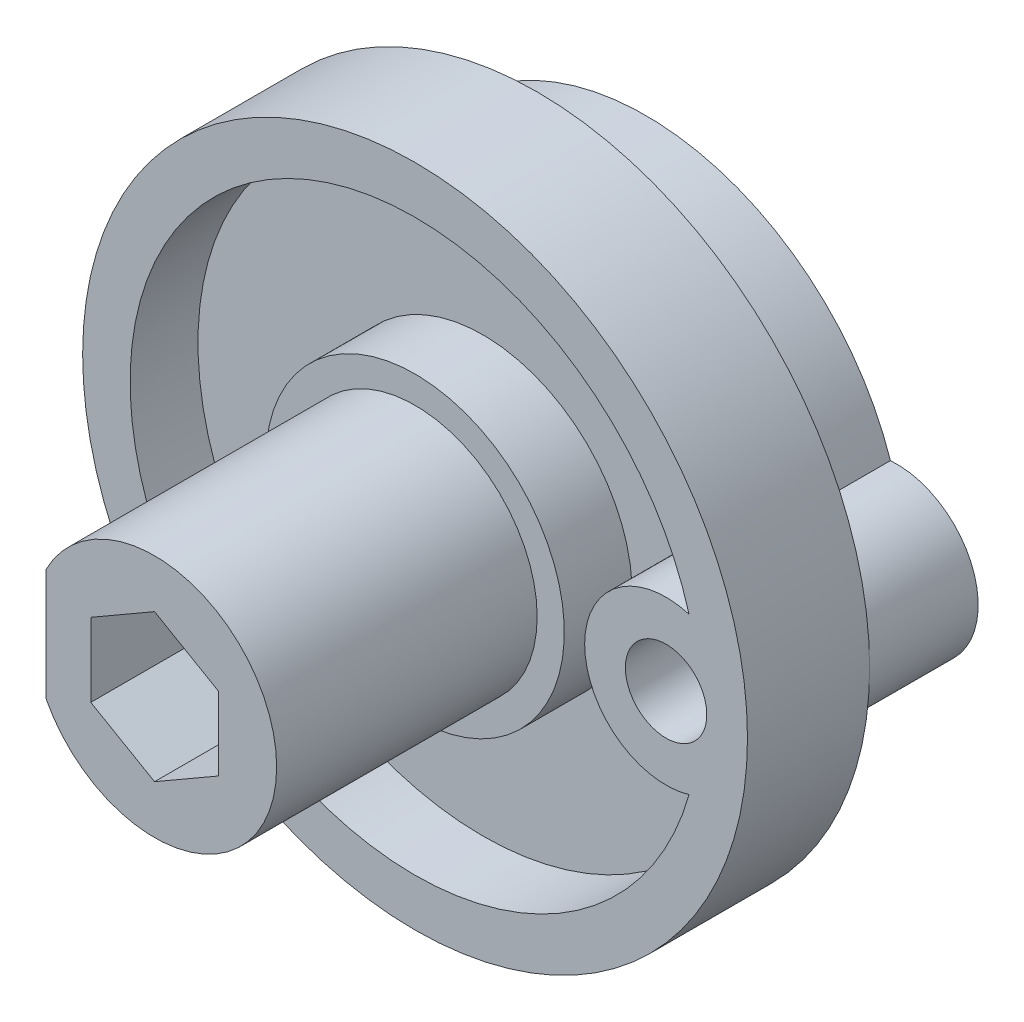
ISO-10303-21;
HEADER;
FILE_DESCRIPTION(('STEP AP214'),'2;1');
FILE_NAME('part.step','',(''),(''),'','','');
FILE_SCHEMA(('AUTOMOTIVE_DESIGN { 1 0 10303 214 1 1 1 1 }'));
ENDSEC;
DATA;
#1=APPLICATION_CONTEXT('core data for automotive mechanical design processes');
#2=APPLICATION_PROTOCOL_DEFINITION('international standard','automotive_design',2000,#1);
#3=PRODUCT_CONTEXT('',#1,'mechanical');
#4=PRODUCT('Part','Part','',(#3));
#5=PRODUCT_RELATED_PRODUCT_CATEGORY('part','',(#4));
#6=PRODUCT_DEFINITION_FORMATION('','',#4);
#7=PRODUCT_DEFINITION_CONTEXT('part definition',#1,'design');
#8=PRODUCT_DEFINITION('design','',#6,#7);
#9=PRODUCT_DEFINITION_SHAPE('','',#8);
#10=(LENGTH_UNIT() NAMED_UNIT(*) SI_UNIT(.MILLI.,.METRE.));
#11=(NAMED_UNIT(*) PLANE_ANGLE_UNIT() SI_UNIT($,.RADIAN.));
#12=(NAMED_UNIT(*) SI_UNIT($,.STERADIAN.) SOLID_ANGLE_UNIT());
#13=UNCERTAINTY_MEASURE_WITH_UNIT(LENGTH_MEASURE(1.E-05),#10,'distance_accuracy_value','');
#14=(GEOMETRIC_REPRESENTATION_CONTEXT(3) GLOBAL_UNCERTAINTY_ASSIGNED_CONTEXT((#13)) GLOBAL_UNIT_ASSIGNED_CONTEXT((#10,
#11,#12)) REPRESENTATION_CONTEXT('',''));
#15=CARTESIAN_POINT('',(0.,0.,0.));
#16=DIRECTION('',(0.,0.,1.));
#17=DIRECTION('',(1.,0.,0.));
#18=AXIS2_PLACEMENT_3D('',#15,#16,#17);
#19=CARTESIAN_POINT('',(-4.,-2.06155281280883,14.1));
#20=DIRECTION('',(1.,0.,0.));
#21=DIRECTION('',(0.,0.,-1.));
#22=AXIS2_PLACEMENT_3D('',#19,#20,#21);
#23=PLANE('',#22);
#24=DIRECTION('',(0.,0.,1.));
#25=VECTOR('',#24,1.);
#26=CARTESIAN_POINT('',(-4.,-2.06155281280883,4.5));
#27=LINE('',#26,#25);
#28=CARTESIAN_POINT('',(-4.,-2.06155281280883,14.1));
#29=VERTEX_POINT('',#28);
#30=CARTESIAN_POINT('',(-4.,-2.06155281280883,4.5));
#31=VERTEX_POINT('',#30);
#32=EDGE_CURVE('E184',#29,#31,#27,.F.);
#33=ORIENTED_EDGE('',*,*,#32,.F.);
#34=DIRECTION('',(0.,1.,0.));
#35=VECTOR('',#34,1.);
#36=CARTESIAN_POINT('',(-4.,0.,14.1));
#37=LINE('',#36,#35);
#38=CARTESIAN_POINT('',(-4.,2.06155281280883,14.1));
#39=VERTEX_POINT('',#38);
#40=EDGE_CURVE('E186',#29,#39,#37,.T.);
#41=ORIENTED_EDGE('',*,*,#40,.T.);
#42=DIRECTION('',(0.,0.,1.));
#43=VECTOR('',#42,1.);
#44=CARTESIAN_POINT('',(-4.,2.06155281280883,4.5));
#45=LINE('',#44,#43);
#46=CARTESIAN_POINT('',(-4.,2.06155281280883,4.5));
#47=VERTEX_POINT('',#46);
#48=EDGE_CURVE('E179',#47,#39,#45,.T.);
#49=ORIENTED_EDGE('',*,*,#48,.F.);
#50=DIRECTION('',(0.,1.,0.));
#51=VECTOR('',#50,1.);
#52=CARTESIAN_POINT('',(-4.,0.,4.5));
#53=LINE('',#52,#51);
#54=EDGE_CURVE('E189',#47,#31,#53,.F.);
#55=ORIENTED_EDGE('',*,*,#54,.T.);
#56=EDGE_LOOP('',(#33,#41,#49,#55));
#57=FACE_BOUND('',#56,.T.);
#58=ADVANCED_FACE('F16',(#57),#23,.F.);
#59=CARTESIAN_POINT('',(0.,0.,4.5));
#60=DIRECTION('',(0.,0.,1.));
#61=DIRECTION('',(1.,0.,0.));
#62=AXIS2_PLACEMENT_3D('',#59,#60,#61);
#63=CYLINDRICAL_SURFACE('',#62,4.5);
#64=ORIENTED_EDGE('',*,*,#32,.T.);
#65=CARTESIAN_POINT('',(0.,0.,4.5));
#66=DIRECTION('',(0.,0.,1.));
#67=DIRECTION('',(1.,0.,0.));
#68=AXIS2_PLACEMENT_3D('',#65,#66,#67);
#69=CIRCLE('',#68,4.5);
#70=EDGE_CURVE('E196',#31,#47,#69,.T.);
#71=ORIENTED_EDGE('',*,*,#70,.T.);
#72=ORIENTED_EDGE('',*,*,#48,.T.);
#73=CARTESIAN_POINT('',(0.,0.,14.1));
#74=DIRECTION('',(0.,0.,1.));
#75=DIRECTION('',(1.,0.,0.));
#76=AXIS2_PLACEMENT_3D('',#73,#74,#75);
#77=CIRCLE('',#76,4.5);
#78=EDGE_CURVE('E20',#39,#29,#77,.F.);
#79=ORIENTED_EDGE('',*,*,#78,.T.);
#80=EDGE_LOOP('',(#64,#71,#72,#79));
#81=FACE_BOUND('',#80,.T.);
#82=ADVANCED_FACE('F192',(#81),#63,.T.);
#83=CARTESIAN_POINT('',(0.,0.,0.));
#84=DIRECTION('',(0.,0.,-1.));
#85=DIRECTION('',(-1.,0.,0.));
#86=AXIS2_PLACEMENT_3D('',#83,#84,#85);
#87=PLANE('',#86);
#88=CARTESIAN_POINT('',(0.,0.,0.));
#89=DIRECTION('',(0.,0.,1.));
#90=DIRECTION('',(1.,0.,0.));
#91=AXIS2_PLACEMENT_3D('',#88,#89,#90);
#92=CIRCLE('',#91,4.);
#93=CARTESIAN_POINT('',(3.92905841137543,-0.750000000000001,0.));
#94=VERTEX_POINT('',#93);
#95=CARTESIAN_POINT('',(0.749999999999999,-3.92905841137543,0.));
#96=VERTEX_POINT('',#95);
#97=EDGE_CURVE('E357',#94,#96,#92,.F.);
#98=ORIENTED_EDGE('',*,*,#97,.F.);
#99=DIRECTION('',(1.,0.,0.));
#100=VECTOR('',#99,1.);
#101=CARTESIAN_POINT('',(3.92905841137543,-0.750000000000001,0.));
#102=LINE('',#101,#100);
#103=CARTESIAN_POINT('',(6.34526249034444,-0.750000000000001,0.));
#104=VERTEX_POINT('',#103);
#105=EDGE_CURVE('E350',#104,#94,#102,.F.);
#106=ORIENTED_EDGE('',*,*,#105,.F.);
#107=CARTESIAN_POINT('',(9.25,0.,0.));
#108=DIRECTION('',(0.,0.,-1.));
#109=DIRECTION('',(-1.,0.,0.));
#110=AXIS2_PLACEMENT_3D('',#107,#108,#109);
#111=CIRCLE('',#110,3.);
#112=CARTESIAN_POINT('',(7.59797297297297,-2.50415788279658,0.));
#113=VERTEX_POINT('',#112);
#114=EDGE_CURVE('E440',#113,#104,#111,.T.);
#115=ORIENTED_EDGE('',*,*,#114,.F.);
#116=CARTESIAN_POINT('',(0.,0.,0.));
#117=DIRECTION('',(0.,0.,1.));
#118=DIRECTION('',(1.,0.,0.));
#119=AXIS2_PLACEMENT_3D('',#116,#117,#118);
#120=CIRCLE('',#119,8.);
#121=CARTESIAN_POINT('',(0.749999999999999,-7.964766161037,0.));
#122=VERTEX_POINT('',#121);
#123=EDGE_CURVE('E365',#113,#122,#120,.F.);
#124=ORIENTED_EDGE('',*,*,#123,.T.);
#125=DIRECTION('',(0.,1.,0.));
#126=VECTOR('',#125,1.);
#127=CARTESIAN_POINT('',(0.749999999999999,-7.964766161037,0.));
#128=LINE('',#127,#126);
#129=EDGE_CURVE('E361',#96,#122,#128,.F.);
#130=ORIENTED_EDGE('',*,*,#129,.F.);
#131=EDGE_LOOP('',(#98,#106,#115,#124,#130));
#132=FACE_BOUND('',#131,.T.);
#133=ADVANCED_FACE('F670',(#132),#87,.T.);
#134=CARTESIAN_POINT('',(0.,0.,0.));
#135=DIRECTION('',(0.,0.,-1.));
#136=DIRECTION('',(-1.,0.,0.));
#137=AXIS2_PLACEMENT_3D('',#134,#135,#136);
#138=PLANE('',#137);
#139=DIRECTION('',(0.,1.,0.));
#140=VECTOR('',#139,1.);
#141=CARTESIAN_POINT('',(0.750000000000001,3.92905841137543,0.));
#142=LINE('',#141,#140);
#143=CARTESIAN_POINT('',(0.750000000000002,7.96476616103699,0.));
#144=VERTEX_POINT('',#143);
#145=CARTESIAN_POINT('',(0.750000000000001,3.92905841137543,0.));
#146=VERTEX_POINT('',#145);
#147=EDGE_CURVE('E341',#144,#146,#142,.F.);
#148=ORIENTED_EDGE('',*,*,#147,.F.);
#149=CARTESIAN_POINT('',(0.,0.,0.));
#150=DIRECTION('',(0.,0.,1.));
#151=DIRECTION('',(1.,0.,0.));
#152=AXIS2_PLACEMENT_3D('',#149,#150,#151);
#153=CIRCLE('',#152,8.);
#154=CARTESIAN_POINT('',(7.59797297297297,2.50415788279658,0.));
#155=VERTEX_POINT('',#154);
#156=EDGE_CURVE('E334',#144,#155,#153,.F.);
#157=ORIENTED_EDGE('',*,*,#156,.T.);
#158=CARTESIAN_POINT('',(9.25,0.,0.));
#159=DIRECTION('',(0.,0.,-1.));
#160=DIRECTION('',(-1.,0.,0.));
#161=AXIS2_PLACEMENT_3D('',#158,#159,#160);
#162=CIRCLE('',#161,3.);
#163=CARTESIAN_POINT('',(6.34526249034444,0.75,0.));
#164=VERTEX_POINT('',#163);
#165=EDGE_CURVE('E330',#164,#155,#162,.T.);
#166=ORIENTED_EDGE('',*,*,#165,.F.);
#167=DIRECTION('',(1.,0.,0.));
#168=VECTOR('',#167,1.);
#169=CARTESIAN_POINT('',(7.964766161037,0.75,0.));
#170=LINE('',#169,#168);
#171=CARTESIAN_POINT('',(3.92905841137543,0.75,0.));
#172=VERTEX_POINT('',#171);
#173=EDGE_CURVE('E349',#172,#164,#170,.T.);
#174=ORIENTED_EDGE('',*,*,#173,.F.);
#175=CARTESIAN_POINT('',(0.,0.,0.));
#176=DIRECTION('',(0.,0.,1.));
#177=DIRECTION('',(1.,0.,0.));
#178=AXIS2_PLACEMENT_3D('',#175,#176,#177);
#179=CIRCLE('',#178,4.);
#180=EDGE_CURVE('E345',#146,#172,#179,.F.);
#181=ORIENTED_EDGE('',*,*,#180,.F.);
#182=EDGE_LOOP('',(#148,#157,#166,#174,#181));
#183=FACE_BOUND('',#182,.T.);
#184=ADVANCED_FACE('F667',(#183),#138,.T.);
#185=CARTESIAN_POINT('',(0.,0.,14.1));
#186=DIRECTION('',(0.,0.,-1.));
#187=DIRECTION('',(-1.,0.,0.));
#188=AXIS2_PLACEMENT_3D('',#185,#186,#187);
#189=PLANE('',#188);
#190=DIRECTION('',(0.,1.,0.));
#191=VECTOR('',#190,1.);
#192=CARTESIAN_POINT('',(2.35,-1.35677313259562,14.1));
#193=LINE('',#192,#191);
#194=CARTESIAN_POINT('',(2.35,1.35677313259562,14.1));
#195=VERTEX_POINT('',#194);
#196=CARTESIAN_POINT('',(2.35,-1.35677313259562,14.1));
#197=VERTEX_POINT('',#196);
#198=EDGE_CURVE('E199',#195,#197,#193,.F.);
#199=ORIENTED_EDGE('',*,*,#198,.T.);
#200=DIRECTION('',(0.866025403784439,0.5,0.));
#201=VECTOR('',#200,1.);
#202=CARTESIAN_POINT('',(0.,-2.71354626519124,14.1));
#203=LINE('',#202,#201);
#204=CARTESIAN_POINT('',(0.,-2.71354626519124,14.1));
#205=VERTEX_POINT('',#204);
#206=EDGE_CURVE('E204',#197,#205,#203,.F.);
#207=ORIENTED_EDGE('',*,*,#206,.T.);
#208=DIRECTION('',(0.866025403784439,-0.5,0.));
#209=VECTOR('',#208,1.);
#210=CARTESIAN_POINT('',(-2.35,-1.35677313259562,14.1));
#211=LINE('',#210,#209);
#212=CARTESIAN_POINT('',(-2.35,-1.35677313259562,14.1));
#213=VERTEX_POINT('',#212);
#214=EDGE_CURVE('E210',#205,#213,#211,.F.);
#215=ORIENTED_EDGE('',*,*,#214,.T.);
#216=DIRECTION('',(0.,1.,0.));
#217=VECTOR('',#216,1.);
#218=CARTESIAN_POINT('',(-2.35,1.35677313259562,14.1));
#219=LINE('',#218,#217);
#220=CARTESIAN_POINT('',(-2.35,1.35677313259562,14.1));
#221=VERTEX_POINT('',#220);
#222=EDGE_CURVE('E216',#213,#221,#219,.T.);
#223=ORIENTED_EDGE('',*,*,#222,.T.);
#224=DIRECTION('',(-0.866025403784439,-0.5,0.));
#225=VECTOR('',#224,1.);
#226=CARTESIAN_POINT('',(0.,2.71354626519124,14.1));
#227=LINE('',#226,#225);
#228=CARTESIAN_POINT('',(0.,2.71354626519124,14.1));
#229=VERTEX_POINT('',#228);
#230=EDGE_CURVE('E222',#221,#229,#227,.F.);
#231=ORIENTED_EDGE('',*,*,#230,.T.);
#232=DIRECTION('',(-0.866025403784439,0.5,0.));
#233=VECTOR('',#232,1.);
#234=CARTESIAN_POINT('',(2.35,1.35677313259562,14.1));
#235=LINE('',#234,#233);
#236=EDGE_CURVE('E232',#229,#195,#235,.F.);
#237=ORIENTED_EDGE('',*,*,#236,.T.);
#238=EDGE_LOOP('',(#199,#207,#215,#223,#231,#237));
#239=FACE_BOUND('',#238,.T.);
#240=ORIENTED_EDGE('',*,*,#78,.F.);
#241=ORIENTED_EDGE('',*,*,#40,.F.);
#242=EDGE_LOOP('',(#240,#241));
#243=FACE_BOUND('',#242,.T.);
#244=ADVANCED_FACE('F194',(#239,#243),#189,.F.);
#245=CARTESIAN_POINT('',(0.,0.,0.));
#246=DIRECTION('',(0.,0.,-1.));
#247=DIRECTION('',(-1.,0.,0.));
#248=AXIS2_PLACEMENT_3D('',#245,#246,#247);
#249=PLANE('',#248);
#250=DIRECTION('',(1.,0.,0.));
#251=VECTOR('',#250,1.);
#252=CARTESIAN_POINT('',(-7.964766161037,-0.749999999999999,0.));
#253=LINE('',#252,#251);
#254=CARTESIAN_POINT('',(-3.92905841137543,-0.749999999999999,0.));
#255=VERTEX_POINT('',#254);
#256=CARTESIAN_POINT('',(-7.964766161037,-0.749999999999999,0.));
#257=VERTEX_POINT('',#256);
#258=EDGE_CURVE('E327',#255,#257,#253,.F.);
#259=ORIENTED_EDGE('',*,*,#258,.F.);
#260=CARTESIAN_POINT('',(0.,0.,0.));
#261=DIRECTION('',(0.,0.,1.));
#262=DIRECTION('',(1.,0.,0.));
#263=AXIS2_PLACEMENT_3D('',#260,#261,#262);
#264=CIRCLE('',#263,4.);
#265=CARTESIAN_POINT('',(-0.75,-3.92905841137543,0.));
#266=VERTEX_POINT('',#265);
#267=EDGE_CURVE('E323',#266,#255,#264,.F.);
#268=ORIENTED_EDGE('',*,*,#267,.F.);
#269=DIRECTION('',(0.,1.,0.));
#270=VECTOR('',#269,1.);
#271=CARTESIAN_POINT('',(-0.75,-3.92905841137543,0.));
#272=LINE('',#271,#270);
#273=CARTESIAN_POINT('',(-0.75,-7.964766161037,0.));
#274=VERTEX_POINT('',#273);
#275=EDGE_CURVE('E316',#274,#266,#272,.T.);
#276=ORIENTED_EDGE('',*,*,#275,.F.);
#277=CARTESIAN_POINT('',(0.,0.,0.));
#278=DIRECTION('',(0.,0.,1.));
#279=DIRECTION('',(1.,0.,0.));
#280=AXIS2_PLACEMENT_3D('',#277,#278,#279);
#281=CIRCLE('',#280,8.);
#282=EDGE_CURVE('E231',#274,#257,#281,.F.);
#283=ORIENTED_EDGE('',*,*,#282,.T.);
#284=EDGE_LOOP('',(#259,#268,#276,#283));
#285=FACE_BOUND('',#284,.T.);
#286=ADVANCED_FACE('F660',(#285),#249,.T.);
#287=CARTESIAN_POINT('',(0.,0.,0.));
#288=DIRECTION('',(0.,0.,-1.));
#289=DIRECTION('',(-1.,0.,0.));
#290=AXIS2_PLACEMENT_3D('',#287,#288,#289);
#291=PLANE('',#290);
#292=DIRECTION('',(1.,0.,0.));
#293=VECTOR('',#292,1.);
#294=CARTESIAN_POINT('',(-3.92905841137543,0.75,0.));
#295=LINE('',#294,#293);
#296=CARTESIAN_POINT('',(-7.964766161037,0.75,0.));
#297=VERTEX_POINT('',#296);
#298=CARTESIAN_POINT('',(-3.92905841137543,0.75,0.));
#299=VERTEX_POINT('',#298);
#300=EDGE_CURVE('E307',#297,#299,#295,.T.);
#301=ORIENTED_EDGE('',*,*,#300,.F.);
#302=CARTESIAN_POINT('',(0.,0.,0.));
#303=DIRECTION('',(0.,0.,1.));
#304=DIRECTION('',(1.,0.,0.));
#305=AXIS2_PLACEMENT_3D('',#302,#303,#304);
#306=CIRCLE('',#305,8.);
#307=CARTESIAN_POINT('',(-0.75,7.964766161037,0.));
#308=VERTEX_POINT('',#307);
#309=EDGE_CURVE('E300',#297,#308,#306,.F.);
#310=ORIENTED_EDGE('',*,*,#309,.T.);
#311=DIRECTION('',(0.,1.,0.));
#312=VECTOR('',#311,1.);
#313=CARTESIAN_POINT('',(-0.75,7.964766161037,0.));
#314=LINE('',#313,#312);
#315=CARTESIAN_POINT('',(-0.75,3.92905841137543,0.));
#316=VERTEX_POINT('',#315);
#317=EDGE_CURVE('E312',#316,#308,#314,.T.);
#318=ORIENTED_EDGE('',*,*,#317,.F.);
#319=CARTESIAN_POINT('',(0.,0.,0.));
#320=DIRECTION('',(0.,0.,1.));
#321=DIRECTION('',(1.,0.,0.));
#322=AXIS2_PLACEMENT_3D('',#319,#320,#321);
#323=CIRCLE('',#322,4.);
#324=EDGE_CURVE('E311',#299,#316,#323,.F.);
#325=ORIENTED_EDGE('',*,*,#324,.F.);
#326=EDGE_LOOP('',(#301,#310,#318,#325));
#327=FACE_BOUND('',#326,.T.);
#328=ADVANCED_FACE('F446',(#327),#291,.T.);
#329=CARTESIAN_POINT('',(0.,0.,4.5));
#330=DIRECTION('',(0.,0.,-1.));
#331=DIRECTION('',(-1.,0.,0.));
#332=AXIS2_PLACEMENT_3D('',#329,#330,#331);
#333=PLANE('',#332);
#334=ORIENTED_EDGE('',*,*,#54,.F.);
#335=ORIENTED_EDGE('',*,*,#70,.F.);
#336=EDGE_LOOP('',(#334,#335));
#337=FACE_BOUND('',#336,.T.);
#338=CARTESIAN_POINT('',(0.,0.,4.5));
#339=DIRECTION('',(0.,0.,-1.));
#340=DIRECTION('',(-1.,0.,0.));
#341=AXIS2_PLACEMENT_3D('',#338,#339,#340);
#342=CIRCLE('',#341,5.5);
#343=CARTESIAN_POINT('',(-5.5,0.,4.5));
#344=VERTEX_POINT('',#343);
#345=EDGE_CURVE('E299',#344,#344,#342,.T.);
#346=ORIENTED_EDGE('',*,*,#345,.F.);
#347=EDGE_LOOP('',(#346));
#348=FACE_BOUND('',#347,.T.);
#349=ADVANCED_FACE('F442',(#337,#348),#333,.F.);
#350=CARTESIAN_POINT('',(9.25,0.,4.5));
#351=DIRECTION('',(0.,0.,-1.));
#352=DIRECTION('',(-1.,0.,0.));
#353=AXIS2_PLACEMENT_3D('',#350,#351,#352);
#354=CYLINDRICAL_SURFACE('',#353,3.);
#355=DIRECTION('',(0.,0.,1.));
#356=VECTOR('',#355,1.);
#357=CARTESIAN_POINT('',(7.59797297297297,-2.50415788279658,-4.));
#358=LINE('',#357,#356);
#359=CARTESIAN_POINT('',(7.59797297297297,-2.50415788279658,-4.));
#360=VERTEX_POINT('',#359);
#361=EDGE_CURVE('E362',#360,#113,#358,.T.);
#362=ORIENTED_EDGE('',*,*,#361,.T.);
#363=ORIENTED_EDGE('',*,*,#114,.T.);
#364=DIRECTION('',(0.,0.,-1.));
#365=VECTOR('',#364,1.);
#366=CARTESIAN_POINT('',(6.34526249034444,-0.750000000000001,0.));
#367=LINE('',#366,#365);
#368=CARTESIAN_POINT('',(6.34526249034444,-0.750000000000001,-4.));
#369=VERTEX_POINT('',#368);
#370=EDGE_CURVE('E351',#369,#104,#367,.F.);
#371=ORIENTED_EDGE('',*,*,#370,.F.);
#372=CARTESIAN_POINT('',(9.25,0.,-4.));
#373=DIRECTION('',(0.,0.,-1.));
#374=DIRECTION('',(-1.,0.,0.));
#375=AXIS2_PLACEMENT_3D('',#372,#373,#374);
#376=CIRCLE('',#375,3.);
#377=EDGE_CURVE('E422',#369,#360,#376,.F.);
#378=ORIENTED_EDGE('',*,*,#377,.T.);
#379=EDGE_LOOP('',(#362,#363,#371,#378));
#380=FACE_BOUND('',#379,.T.);
#381=ADVANCED_FACE('F445',(#380),#354,.T.);
#382=CARTESIAN_POINT('',(0.,0.,-4.));
#383=DIRECTION('',(0.,0.,1.));
#384=DIRECTION('',(1.,0.,0.));
#385=AXIS2_PLACEMENT_3D('',#382,#383,#384);
#386=CYLINDRICAL_SURFACE('',#385,8.);
#387=CARTESIAN_POINT('',(0.,0.,-4.));
#388=DIRECTION('',(0.,0.,1.));
#389=DIRECTION('',(1.,0.,0.));
#390=AXIS2_PLACEMENT_3D('',#387,#388,#389);
#391=CIRCLE('',#390,8.);
#392=CARTESIAN_POINT('',(0.749999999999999,-7.964766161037,-4.));
#393=VERTEX_POINT('',#392);
#394=EDGE_CURVE('E281',#360,#393,#391,.F.);
#395=ORIENTED_EDGE('',*,*,#394,.T.);
#396=DIRECTION('',(0.,0.,-1.));
#397=VECTOR('',#396,1.);
#398=CARTESIAN_POINT('',(0.749999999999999,-7.964766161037,0.));
#399=LINE('',#398,#397);
#400=EDGE_CURVE('E358',#122,#393,#399,.T.);
#401=ORIENTED_EDGE('',*,*,#400,.F.);
#402=ORIENTED_EDGE('',*,*,#123,.F.);
#403=ORIENTED_EDGE('',*,*,#361,.F.);
#404=EDGE_LOOP('',(#395,#401,#402,#403));
#405=FACE_BOUND('',#404,.T.);
#406=ADVANCED_FACE('F650',(#405),#386,.F.);
#407=CARTESIAN_POINT('',(0.749999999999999,-7.964766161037,0.));
#408=DIRECTION('',(1.,0.,0.));
#409=DIRECTION('',(0.,0.,-1.));
#410=AXIS2_PLACEMENT_3D('',#407,#408,#409);
#411=PLANE('',#410);
#412=ORIENTED_EDGE('',*,*,#129,.T.);
#413=ORIENTED_EDGE('',*,*,#400,.T.);
#414=DIRECTION('',(0.,1.,0.));
#415=VECTOR('',#414,1.);
#416=CARTESIAN_POINT('',(0.749999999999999,0.,-4.));
#417=LINE('',#416,#415);
#418=CARTESIAN_POINT('',(0.749999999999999,-3.92905841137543,-4.));
#419=VERTEX_POINT('',#418);
#420=EDGE_CURVE('E279',#393,#419,#417,.T.);
#421=ORIENTED_EDGE('',*,*,#420,.T.);
#422=DIRECTION('',(0.,0.,1.));
#423=VECTOR('',#422,1.);
#424=CARTESIAN_POINT('',(0.75,-3.92905841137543,-4.));
#425=LINE('',#424,#423);
#426=EDGE_CURVE('E354',#96,#419,#425,.F.);
#427=ORIENTED_EDGE('',*,*,#426,.F.);
#428=EDGE_LOOP('',(#412,#413,#421,#427));
#429=FACE_BOUND('',#428,.T.);
#430=ADVANCED_FACE('F646',(#429),#411,.T.);
#431=CARTESIAN_POINT('',(0.,0.,-4.));
#432=DIRECTION('',(0.,0.,1.));
#433=DIRECTION('',(1.,0.,0.));
#434=AXIS2_PLACEMENT_3D('',#431,#432,#433);
#435=CYLINDRICAL_SURFACE('',#434,4.);
#436=ORIENTED_EDGE('',*,*,#426,.T.);
#437=CARTESIAN_POINT('',(0.,0.,-4.));
#438=DIRECTION('',(0.,0.,1.));
#439=DIRECTION('',(1.,0.,0.));
#440=AXIS2_PLACEMENT_3D('',#437,#438,#439);
#441=CIRCLE('',#440,4.);
#442=CARTESIAN_POINT('',(3.92905841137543,-0.750000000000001,-4.));
#443=VERTEX_POINT('',#442);
#444=EDGE_CURVE('E278',#419,#443,#441,.T.);
#445=ORIENTED_EDGE('',*,*,#444,.T.);
#446=DIRECTION('',(0.,0.,-1.));
#447=VECTOR('',#446,1.);
#448=CARTESIAN_POINT('',(3.92905841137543,-0.750000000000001,0.));
#449=LINE('',#448,#447);
#450=EDGE_CURVE('E346',#94,#443,#449,.T.);
#451=ORIENTED_EDGE('',*,*,#450,.F.);
#452=ORIENTED_EDGE('',*,*,#97,.T.);
#453=EDGE_LOOP('',(#436,#445,#451,#452));
#454=FACE_BOUND('',#453,.T.);
#455=ADVANCED_FACE('F642',(#454),#435,.T.);
#456=CARTESIAN_POINT('',(3.92905841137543,-0.750000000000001,0.));
#457=DIRECTION('',(0.,-1.,0.));
#458=DIRECTION('',(0.,0.,-1.));
#459=AXIS2_PLACEMENT_3D('',#456,#457,#458);
#460=PLANE('',#459);
#461=ORIENTED_EDGE('',*,*,#450,.T.);
#462=DIRECTION('',(1.,0.,0.));
#463=VECTOR('',#462,1.);
#464=CARTESIAN_POINT('',(0.,-0.750000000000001,-4.));
#465=LINE('',#464,#463);
#466=EDGE_CURVE('E275',#443,#369,#465,.T.);
#467=ORIENTED_EDGE('',*,*,#466,.T.);
#468=ORIENTED_EDGE('',*,*,#370,.T.);
#469=ORIENTED_EDGE('',*,*,#105,.T.);
#470=EDGE_LOOP('',(#461,#467,#468,#469));
#471=FACE_BOUND('',#470,.T.);
#472=ADVANCED_FACE('F638',(#471),#460,.T.);
#473=CARTESIAN_POINT('',(7.964766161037,0.75,0.));
#474=DIRECTION('',(0.,1.,0.));
#475=DIRECTION('',(0.,0.,1.));
#476=AXIS2_PLACEMENT_3D('',#473,#474,#475);
#477=PLANE('',#476);
#478=DIRECTION('',(0.,0.,1.));
#479=VECTOR('',#478,1.);
#480=CARTESIAN_POINT('',(3.92905841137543,0.75,-4.));
#481=LINE('',#480,#479);
#482=CARTESIAN_POINT('',(3.92905841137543,0.75,-4.));
#483=VERTEX_POINT('',#482);
#484=EDGE_CURVE('E342',#172,#483,#481,.F.);
#485=ORIENTED_EDGE('',*,*,#484,.F.);
#486=ORIENTED_EDGE('',*,*,#173,.T.);
#487=DIRECTION('',(0.,0.,-1.));
#488=VECTOR('',#487,1.);
#489=CARTESIAN_POINT('',(6.34526249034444,0.750000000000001,4.5));
#490=LINE('',#489,#488);
#491=CARTESIAN_POINT('',(6.34526249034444,0.75,-4.));
#492=VERTEX_POINT('',#491);
#493=EDGE_CURVE('E331',#492,#164,#490,.F.);
#494=ORIENTED_EDGE('',*,*,#493,.F.);
#495=DIRECTION('',(1.,0.,0.));
#496=VECTOR('',#495,1.);
#497=CARTESIAN_POINT('',(0.,0.75,-4.));
#498=LINE('',#497,#496);
#499=EDGE_CURVE('E273',#492,#483,#498,.F.);
#500=ORIENTED_EDGE('',*,*,#499,.T.);
#501=EDGE_LOOP('',(#485,#486,#494,#500));
#502=FACE_BOUND('',#501,.T.);
#503=ADVANCED_FACE('F634',(#502),#477,.T.);
#504=CARTESIAN_POINT('',(0.,0.,-4.));
#505=DIRECTION('',(0.,0.,1.));
#506=DIRECTION('',(1.,0.,0.));
#507=AXIS2_PLACEMENT_3D('',#504,#505,#506);
#508=CYLINDRICAL_SURFACE('',#507,4.);
#509=ORIENTED_EDGE('',*,*,#484,.T.);
#510=CARTESIAN_POINT('',(0.,0.,-4.));
#511=DIRECTION('',(0.,0.,1.));
#512=DIRECTION('',(1.,0.,0.));
#513=AXIS2_PLACEMENT_3D('',#510,#511,#512);
#514=CIRCLE('',#513,4.);
#515=CARTESIAN_POINT('',(0.750000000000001,3.92905841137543,-4.));
#516=VERTEX_POINT('',#515);
#517=EDGE_CURVE('E272',#483,#516,#514,.T.);
#518=ORIENTED_EDGE('',*,*,#517,.T.);
#519=DIRECTION('',(0.,0.,-1.));
#520=VECTOR('',#519,1.);
#521=CARTESIAN_POINT('',(0.750000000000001,3.92905841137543,0.));
#522=LINE('',#521,#520);
#523=EDGE_CURVE('E338',#146,#516,#522,.T.);
#524=ORIENTED_EDGE('',*,*,#523,.F.);
#525=ORIENTED_EDGE('',*,*,#180,.T.);
#526=EDGE_LOOP('',(#509,#518,#524,#525));
#527=FACE_BOUND('',#526,.T.);
#528=ADVANCED_FACE('F630',(#527),#508,.T.);
#529=CARTESIAN_POINT('',(0.750000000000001,3.92905841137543,0.));
#530=DIRECTION('',(1.,0.,0.));
#531=DIRECTION('',(0.,0.,-1.));
#532=AXIS2_PLACEMENT_3D('',#529,#530,#531);
#533=PLANE('',#532);
#534=ORIENTED_EDGE('',*,*,#147,.T.);
#535=ORIENTED_EDGE('',*,*,#523,.T.);
#536=DIRECTION('',(0.,1.,0.));
#537=VECTOR('',#536,1.);
#538=CARTESIAN_POINT('',(0.750000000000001,0.,-4.));
#539=LINE('',#538,#537);
#540=CARTESIAN_POINT('',(0.750000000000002,7.96476616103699,-4.));
#541=VERTEX_POINT('',#540);
#542=EDGE_CURVE('E269',#516,#541,#539,.T.);
#543=ORIENTED_EDGE('',*,*,#542,.T.);
#544=DIRECTION('',(0.,0.,1.));
#545=VECTOR('',#544,1.);
#546=CARTESIAN_POINT('',(0.750000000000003,7.964766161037,-4.));
#547=LINE('',#546,#545);
#548=EDGE_CURVE('E335',#541,#144,#547,.T.);
#549=ORIENTED_EDGE('',*,*,#548,.T.);
#550=EDGE_LOOP('',(#534,#535,#543,#549));
#551=FACE_BOUND('',#550,.T.);
#552=ADVANCED_FACE('F626',(#551),#533,.T.);
#553=CARTESIAN_POINT('',(0.,0.,-4.));
#554=DIRECTION('',(0.,0.,1.));
#555=DIRECTION('',(1.,0.,0.));
#556=AXIS2_PLACEMENT_3D('',#553,#554,#555);
#557=CYLINDRICAL_SURFACE('',#556,8.);
#558=ORIENTED_EDGE('',*,*,#156,.F.);
#559=ORIENTED_EDGE('',*,*,#548,.F.);
#560=CARTESIAN_POINT('',(0.,0.,-4.));
#561=DIRECTION('',(0.,0.,1.));
#562=DIRECTION('',(1.,0.,0.));
#563=AXIS2_PLACEMENT_3D('',#560,#561,#562);
#564=CIRCLE('',#563,8.);
#565=CARTESIAN_POINT('',(7.59797297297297,2.50415788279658,-4.));
#566=VERTEX_POINT('',#565);
#567=EDGE_CURVE('E271',#541,#566,#564,.F.);
#568=ORIENTED_EDGE('',*,*,#567,.T.);
#569=DIRECTION('',(0.,0.,-1.));
#570=VECTOR('',#569,1.);
#571=CARTESIAN_POINT('',(7.59797297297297,2.50415788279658,4.5));
#572=LINE('',#571,#570);
#573=EDGE_CURVE('E203',#155,#566,#572,.T.);
#574=ORIENTED_EDGE('',*,*,#573,.F.);
#575=EDGE_LOOP('',(#558,#559,#568,#574));
#576=FACE_BOUND('',#575,.T.);
#577=ADVANCED_FACE('F622',(#576),#557,.F.);
#578=CARTESIAN_POINT('',(9.25,0.,4.5));
#579=DIRECTION('',(0.,0.,-1.));
#580=DIRECTION('',(-1.,0.,0.));
#581=AXIS2_PLACEMENT_3D('',#578,#579,#580);
#582=CYLINDRICAL_SURFACE('',#581,3.);
#583=ORIENTED_EDGE('',*,*,#573,.T.);
#584=CARTESIAN_POINT('',(9.25,0.,-4.));
#585=DIRECTION('',(0.,0.,-1.));
#586=DIRECTION('',(-1.,0.,0.));
#587=AXIS2_PLACEMENT_3D('',#584,#585,#586);
#588=CIRCLE('',#587,3.);
#589=EDGE_CURVE('E268',#566,#492,#588,.F.);
#590=ORIENTED_EDGE('',*,*,#589,.T.);
#591=ORIENTED_EDGE('',*,*,#493,.T.);
#592=ORIENTED_EDGE('',*,*,#165,.T.);
#593=EDGE_LOOP('',(#583,#590,#591,#592));
#594=FACE_BOUND('',#593,.T.);
#595=ADVANCED_FACE('F619',(#594),#582,.T.);
#596=CARTESIAN_POINT('',(2.35,-1.35677313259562,14.1));
#597=DIRECTION('',(1.,0.,0.));
#598=DIRECTION('',(0.,0.,-1.));
#599=AXIS2_PLACEMENT_3D('',#596,#597,#598);
#600=PLANE('',#599);
#601=DIRECTION('',(0.,0.,1.));
#602=VECTOR('',#601,1.);
#603=CARTESIAN_POINT('',(2.35,-1.35677313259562,14.1));
#604=LINE('',#603,#602);
#605=CARTESIAN_POINT('',(2.35,-1.35677313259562,-4.));
#606=VERTEX_POINT('',#605);
#607=EDGE_CURVE('E202',#606,#197,#604,.T.);
#608=ORIENTED_EDGE('',*,*,#607,.T.);
#609=ORIENTED_EDGE('',*,*,#198,.F.);
#610=DIRECTION('',(0.,0.,1.));
#611=VECTOR('',#610,1.);
#612=CARTESIAN_POINT('',(2.35,1.35677313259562,14.1));
#613=LINE('',#612,#611);
#614=CARTESIAN_POINT('',(2.35,1.35677313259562,-4.));
#615=VERTEX_POINT('',#614);
#616=EDGE_CURVE('E228',#195,#615,#613,.F.);
#617=ORIENTED_EDGE('',*,*,#616,.T.);
#618=DIRECTION('',(0.,1.,0.));
#619=VECTOR('',#618,1.);
#620=CARTESIAN_POINT('',(2.35,0.,-4.));
#621=LINE('',#620,#619);
#622=EDGE_CURVE('E265',#615,#606,#621,.F.);
#623=ORIENTED_EDGE('',*,*,#622,.T.);
#624=EDGE_LOOP('',(#608,#609,#617,#623));
#625=FACE_BOUND('',#624,.T.);
#626=ADVANCED_FACE('F501',(#625),#600,.F.);
#627=CARTESIAN_POINT('',(0.,-2.71354626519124,14.1));
#628=DIRECTION('',(0.5,-0.866025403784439,0.));
#629=DIRECTION('',(0.866025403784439,0.5,0.));
#630=AXIS2_PLACEMENT_3D('',#627,#628,#629);
#631=PLANE('',#630);
#632=DIRECTION('',(0.,0.,1.));
#633=VECTOR('',#632,1.);
#634=CARTESIAN_POINT('',(0.,-2.71354626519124,14.1));
#635=LINE('',#634,#633);
#636=CARTESIAN_POINT('',(0.,-2.71354626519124,-4.00000000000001));
#637=VERTEX_POINT('',#636);
#638=EDGE_CURVE('E207',#637,#205,#635,.T.);
#639=ORIENTED_EDGE('',*,*,#638,.T.);
#640=ORIENTED_EDGE('',*,*,#206,.F.);
#641=ORIENTED_EDGE('',*,*,#607,.F.);
#642=DIRECTION('',(-0.866025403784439,-0.5,0.));
#643=VECTOR('',#642,1.);
#644=CARTESIAN_POINT('',(2.35,-1.35677313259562,-4.));
#645=LINE('',#644,#643);
#646=EDGE_CURVE('E262',#606,#637,#645,.T.);
#647=ORIENTED_EDGE('',*,*,#646,.T.);
#648=EDGE_LOOP('',(#639,#640,#641,#647));
#649=FACE_BOUND('',#648,.T.);
#650=ADVANCED_FACE('F505',(#649),#631,.F.);
#651=CARTESIAN_POINT('',(-2.35,-1.35677313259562,14.1));
#652=DIRECTION('',(-0.5,-0.866025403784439,0.));
#653=DIRECTION('',(0.866025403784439,-0.5,0.));
#654=AXIS2_PLACEMENT_3D('',#651,#652,#653);
#655=PLANE('',#654);
#656=DIRECTION('',(0.,0.,1.));
#657=VECTOR('',#656,1.);
#658=CARTESIAN_POINT('',(-2.35,-1.35677313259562,14.1));
#659=LINE('',#658,#657);
#660=CARTESIAN_POINT('',(-2.35,-1.35677313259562,-4.));
#661=VERTEX_POINT('',#660);
#662=EDGE_CURVE('E213',#661,#213,#659,.T.);
#663=ORIENTED_EDGE('',*,*,#662,.T.);
#664=ORIENTED_EDGE('',*,*,#214,.F.);
#665=ORIENTED_EDGE('',*,*,#638,.F.);
#666=DIRECTION('',(-0.866025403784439,0.5,0.));
#667=VECTOR('',#666,1.);
#668=CARTESIAN_POINT('',(0.,-2.71354626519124,-4.));
#669=LINE('',#668,#667);
#670=EDGE_CURVE('E259',#637,#661,#669,.T.);
#671=ORIENTED_EDGE('',*,*,#670,.T.);
#672=EDGE_LOOP('',(#663,#664,#665,#671));
#673=FACE_BOUND('',#672,.T.);
#674=ADVANCED_FACE('F510',(#673),#655,.F.);
#675=CARTESIAN_POINT('',(-2.35,1.35677313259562,14.1));
#676=DIRECTION('',(-1.,0.,0.));
#677=DIRECTION('',(0.,0.,1.));
#678=AXIS2_PLACEMENT_3D('',#675,#676,#677);
#679=PLANE('',#678);
#680=DIRECTION('',(0.,0.,1.));
#681=VECTOR('',#680,1.);
#682=CARTESIAN_POINT('',(-2.35,1.35677313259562,14.1));
#683=LINE('',#682,#681);
#684=CARTESIAN_POINT('',(-2.35,1.35677313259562,-4.));
#685=VERTEX_POINT('',#684);
#686=EDGE_CURVE('E219',#685,#221,#683,.T.);
#687=ORIENTED_EDGE('',*,*,#686,.T.);
#688=ORIENTED_EDGE('',*,*,#222,.F.);
#689=ORIENTED_EDGE('',*,*,#662,.F.);
#690=DIRECTION('',(0.,1.,0.));
#691=VECTOR('',#690,1.);
#692=CARTESIAN_POINT('',(-2.35,0.,-4.));
#693=LINE('',#692,#691);
#694=EDGE_CURVE('E256',#661,#685,#693,.T.);
#695=ORIENTED_EDGE('',*,*,#694,.T.);
#696=EDGE_LOOP('',(#687,#688,#689,#695));
#697=FACE_BOUND('',#696,.T.);
#698=ADVANCED_FACE('F516',(#697),#679,.F.);
#699=CARTESIAN_POINT('',(0.,2.71354626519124,14.1));
#700=DIRECTION('',(-0.5,0.866025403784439,0.));
#701=DIRECTION('',(-0.866025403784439,-0.5,0.));
#702=AXIS2_PLACEMENT_3D('',#699,#700,#701);
#703=PLANE('',#702);
#704=DIRECTION('',(0.,0.,1.));
#705=VECTOR('',#704,1.);
#706=CARTESIAN_POINT('',(0.,2.71354626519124,14.1));
#707=LINE('',#706,#705);
#708=CARTESIAN_POINT('',(0.,2.71354626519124,-4.00000000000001));
#709=VERTEX_POINT('',#708);
#710=EDGE_CURVE('E225',#709,#229,#707,.T.);
#711=ORIENTED_EDGE('',*,*,#710,.T.);
#712=ORIENTED_EDGE('',*,*,#230,.F.);
#713=ORIENTED_EDGE('',*,*,#686,.F.);
#714=DIRECTION('',(0.866025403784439,0.5,0.));
#715=VECTOR('',#714,1.);
#716=CARTESIAN_POINT('',(-2.35,1.35677313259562,-4.));
#717=LINE('',#716,#715);
#718=EDGE_CURVE('E253',#685,#709,#717,.T.);
#719=ORIENTED_EDGE('',*,*,#718,.T.);
#720=EDGE_LOOP('',(#711,#712,#713,#719));
#721=FACE_BOUND('',#720,.T.);
#722=ADVANCED_FACE('F520',(#721),#703,.F.);
#723=CARTESIAN_POINT('',(2.35,1.35677313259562,14.1));
#724=DIRECTION('',(0.5,0.866025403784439,0.));
#725=DIRECTION('',(-0.866025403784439,0.5,0.));
#726=AXIS2_PLACEMENT_3D('',#723,#724,#725);
#727=PLANE('',#726);
#728=ORIENTED_EDGE('',*,*,#616,.F.);
#729=ORIENTED_EDGE('',*,*,#236,.F.);
#730=ORIENTED_EDGE('',*,*,#710,.F.);
#731=DIRECTION('',(0.866025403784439,-0.5,0.));
#732=VECTOR('',#731,1.);
#733=CARTESIAN_POINT('',(0.,2.71354626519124,-4.));
#734=LINE('',#733,#732);
#735=EDGE_CURVE('E250',#709,#615,#734,.T.);
#736=ORIENTED_EDGE('',*,*,#735,.T.);
#737=EDGE_LOOP('',(#728,#729,#730,#736));
#738=FACE_BOUND('',#737,.T.);
#739=ADVANCED_FACE('F524',(#738),#727,.F.);
#740=CARTESIAN_POINT('',(0.,0.,-4.));
#741=DIRECTION('',(0.,0.,1.));
#742=DIRECTION('',(1.,0.,0.));
#743=AXIS2_PLACEMENT_3D('',#740,#741,#742);
#744=CYLINDRICAL_SURFACE('',#743,8.);
#745=CARTESIAN_POINT('',(0.,0.,-4.));
#746=DIRECTION('',(0.,0.,1.));
#747=DIRECTION('',(1.,0.,0.));
#748=AXIS2_PLACEMENT_3D('',#745,#746,#747);
#749=CIRCLE('',#748,8.);
#750=CARTESIAN_POINT('',(-0.75,-7.964766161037,-4.));
#751=VERTEX_POINT('',#750);
#752=CARTESIAN_POINT('',(-7.964766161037,-0.749999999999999,-4.));
#753=VERTEX_POINT('',#752);
#754=EDGE_CURVE('E249',#751,#753,#749,.F.);
#755=ORIENTED_EDGE('',*,*,#754,.T.);
#756=DIRECTION('',(0.,0.,-1.));
#757=VECTOR('',#756,1.);
#758=CARTESIAN_POINT('',(-7.964766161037,-0.749999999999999,0.));
#759=LINE('',#758,#757);
#760=EDGE_CURVE('E324',#257,#753,#759,.T.);
#761=ORIENTED_EDGE('',*,*,#760,.F.);
#762=ORIENTED_EDGE('',*,*,#282,.F.);
#763=DIRECTION('',(0.,0.,1.));
#764=VECTOR('',#763,1.);
#765=CARTESIAN_POINT('',(-0.75,-7.964766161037,0.));
#766=LINE('',#765,#764);
#767=EDGE_CURVE('E317',#751,#274,#766,.T.);
#768=ORIENTED_EDGE('',*,*,#767,.F.);
#769=EDGE_LOOP('',(#755,#761,#762,#768));
#770=FACE_BOUND('',#769,.T.);
#771=ADVANCED_FACE('F602',(#770),#744,.F.);
#772=CARTESIAN_POINT('',(-7.964766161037,-0.749999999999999,0.));
#773=DIRECTION('',(0.,-1.,0.));
#774=DIRECTION('',(0.,0.,-1.));
#775=AXIS2_PLACEMENT_3D('',#772,#773,#774);
#776=PLANE('',#775);
#777=ORIENTED_EDGE('',*,*,#258,.T.);
#778=ORIENTED_EDGE('',*,*,#760,.T.);
#779=DIRECTION('',(1.,0.,0.));
#780=VECTOR('',#779,1.);
#781=CARTESIAN_POINT('',(0.,-0.749999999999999,-4.));
#782=LINE('',#781,#780);
#783=CARTESIAN_POINT('',(-3.92905841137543,-0.749999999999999,-4.));
#784=VERTEX_POINT('',#783);
#785=EDGE_CURVE('E247',#753,#784,#782,.T.);
#786=ORIENTED_EDGE('',*,*,#785,.T.);
#787=DIRECTION('',(0.,0.,1.));
#788=VECTOR('',#787,1.);
#789=CARTESIAN_POINT('',(-3.92905841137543,-0.749999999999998,-4.));
#790=LINE('',#789,#788);
#791=EDGE_CURVE('E320',#255,#784,#790,.F.);
#792=ORIENTED_EDGE('',*,*,#791,.F.);
#793=EDGE_LOOP('',(#777,#778,#786,#792));
#794=FACE_BOUND('',#793,.T.);
#795=ADVANCED_FACE('F598',(#794),#776,.T.);
#796=CARTESIAN_POINT('',(0.,0.,-4.));
#797=DIRECTION('',(0.,0.,1.));
#798=DIRECTION('',(1.,0.,0.));
#799=AXIS2_PLACEMENT_3D('',#796,#797,#798);
#800=CYLINDRICAL_SURFACE('',#799,4.);
#801=ORIENTED_EDGE('',*,*,#791,.T.);
#802=CARTESIAN_POINT('',(0.,0.,-4.));
#803=DIRECTION('',(0.,0.,1.));
#804=DIRECTION('',(1.,0.,0.));
#805=AXIS2_PLACEMENT_3D('',#802,#803,#804);
#806=CIRCLE('',#805,4.);
#807=CARTESIAN_POINT('',(-0.75,-3.92905841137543,-4.));
#808=VERTEX_POINT('',#807);
#809=EDGE_CURVE('E246',#784,#808,#806,.T.);
#810=ORIENTED_EDGE('',*,*,#809,.T.);
#811=DIRECTION('',(0.,0.,1.));
#812=VECTOR('',#811,1.);
#813=CARTESIAN_POINT('',(-0.75,-3.92905841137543,0.));
#814=LINE('',#813,#812);
#815=EDGE_CURVE('E313',#266,#808,#814,.F.);
#816=ORIENTED_EDGE('',*,*,#815,.F.);
#817=ORIENTED_EDGE('',*,*,#267,.T.);
#818=EDGE_LOOP('',(#801,#810,#816,#817));
#819=FACE_BOUND('',#818,.T.);
#820=ADVANCED_FACE('F594',(#819),#800,.T.);
#821=CARTESIAN_POINT('',(-0.75,-3.92905841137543,0.));
#822=DIRECTION('',(-1.,0.,0.));
#823=DIRECTION('',(0.,0.,1.));
#824=AXIS2_PLACEMENT_3D('',#821,#822,#823);
#825=PLANE('',#824);
#826=ORIENTED_EDGE('',*,*,#275,.T.);
#827=ORIENTED_EDGE('',*,*,#815,.T.);
#828=DIRECTION('',(0.,1.,0.));
#829=VECTOR('',#828,1.);
#830=CARTESIAN_POINT('',(-0.75,0.,-4.));
#831=LINE('',#830,#829);
#832=EDGE_CURVE('E243',#808,#751,#831,.F.);
#833=ORIENTED_EDGE('',*,*,#832,.T.);
#834=ORIENTED_EDGE('',*,*,#767,.T.);
#835=EDGE_LOOP('',(#826,#827,#833,#834));
#836=FACE_BOUND('',#835,.T.);
#837=ADVANCED_FACE('F590',(#836),#825,.T.);
#838=CARTESIAN_POINT('',(-0.75,7.964766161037,0.));
#839=DIRECTION('',(-1.,0.,0.));
#840=DIRECTION('',(0.,0.,1.));
#841=AXIS2_PLACEMENT_3D('',#838,#839,#840);
#842=PLANE('',#841);
#843=ORIENTED_EDGE('',*,*,#317,.T.);
#844=DIRECTION('',(0.,0.,1.));
#845=VECTOR('',#844,1.);
#846=CARTESIAN_POINT('',(-0.75,7.964766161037,-4.));
#847=LINE('',#846,#845);
#848=CARTESIAN_POINT('',(-0.75,7.964766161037,-4.));
#849=VERTEX_POINT('',#848);
#850=EDGE_CURVE('E297',#308,#849,#847,.F.);
#851=ORIENTED_EDGE('',*,*,#850,.T.);
#852=DIRECTION('',(0.,1.,0.));
#853=VECTOR('',#852,1.);
#854=CARTESIAN_POINT('',(-0.75,0.,-4.));
#855=LINE('',#854,#853);
#856=CARTESIAN_POINT('',(-0.75,3.92905841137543,-4.));
#857=VERTEX_POINT('',#856);
#858=EDGE_CURVE('E241',#849,#857,#855,.F.);
#859=ORIENTED_EDGE('',*,*,#858,.T.);
#860=DIRECTION('',(0.,0.,1.));
#861=VECTOR('',#860,1.);
#862=CARTESIAN_POINT('',(-0.749999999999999,3.92905841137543,-4.));
#863=LINE('',#862,#861);
#864=EDGE_CURVE('E308',#316,#857,#863,.F.);
#865=ORIENTED_EDGE('',*,*,#864,.F.);
#866=EDGE_LOOP('',(#843,#851,#859,#865));
#867=FACE_BOUND('',#866,.T.);
#868=ADVANCED_FACE('F586',(#867),#842,.T.);
#869=CARTESIAN_POINT('',(0.,0.,-4.));
#870=DIRECTION('',(0.,0.,1.));
#871=DIRECTION('',(1.,0.,0.));
#872=AXIS2_PLACEMENT_3D('',#869,#870,#871);
#873=CYLINDRICAL_SURFACE('',#872,4.);
#874=DIRECTION('',(0.,0.,1.));
#875=VECTOR('',#874,1.);
#876=CARTESIAN_POINT('',(-3.92905841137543,0.75,0.));
#877=LINE('',#876,#875);
#878=CARTESIAN_POINT('',(-3.92905841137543,0.75,-4.));
#879=VERTEX_POINT('',#878);
#880=EDGE_CURVE('E304',#299,#879,#877,.F.);
#881=ORIENTED_EDGE('',*,*,#880,.F.);
#882=ORIENTED_EDGE('',*,*,#324,.T.);
#883=ORIENTED_EDGE('',*,*,#864,.T.);
#884=CARTESIAN_POINT('',(0.,0.,-4.));
#885=DIRECTION('',(0.,0.,1.));
#886=DIRECTION('',(1.,0.,0.));
#887=AXIS2_PLACEMENT_3D('',#884,#885,#886);
#888=CIRCLE('',#887,4.);
#889=EDGE_CURVE('E240',#857,#879,#888,.T.);
#890=ORIENTED_EDGE('',*,*,#889,.T.);
#891=EDGE_LOOP('',(#881,#882,#883,#890));
#892=FACE_BOUND('',#891,.T.);
#893=ADVANCED_FACE('F582',(#892),#873,.T.);
#894=CARTESIAN_POINT('',(-3.92905841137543,0.75,0.));
#895=DIRECTION('',(0.,1.,0.));
#896=DIRECTION('',(0.,0.,1.));
#897=AXIS2_PLACEMENT_3D('',#894,#895,#896);
#898=PLANE('',#897);
#899=ORIENTED_EDGE('',*,*,#300,.T.);
#900=ORIENTED_EDGE('',*,*,#880,.T.);
#901=DIRECTION('',(1.,0.,0.));
#902=VECTOR('',#901,1.);
#903=CARTESIAN_POINT('',(0.,0.75,-4.));
#904=LINE('',#903,#902);
#905=CARTESIAN_POINT('',(-7.964766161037,0.75,-4.));
#906=VERTEX_POINT('',#905);
#907=EDGE_CURVE('E237',#879,#906,#904,.F.);
#908=ORIENTED_EDGE('',*,*,#907,.T.);
#909=DIRECTION('',(0.,0.,1.));
#910=VECTOR('',#909,1.);
#911=CARTESIAN_POINT('',(-7.964766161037,0.749999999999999,-4.));
#912=LINE('',#911,#910);
#913=EDGE_CURVE('E301',#906,#297,#912,.T.);
#914=ORIENTED_EDGE('',*,*,#913,.T.);
#915=EDGE_LOOP('',(#899,#900,#908,#914));
#916=FACE_BOUND('',#915,.T.);
#917=ADVANCED_FACE('F578',(#916),#898,.T.);
#918=CARTESIAN_POINT('',(0.,0.,-4.));
#919=DIRECTION('',(0.,0.,1.));
#920=DIRECTION('',(1.,0.,0.));
#921=AXIS2_PLACEMENT_3D('',#918,#919,#920);
#922=CYLINDRICAL_SURFACE('',#921,8.);
#923=ORIENTED_EDGE('',*,*,#309,.F.);
#924=ORIENTED_EDGE('',*,*,#913,.F.);
#925=CARTESIAN_POINT('',(0.,0.,-4.));
#926=DIRECTION('',(0.,0.,1.));
#927=DIRECTION('',(1.,0.,0.));
#928=AXIS2_PLACEMENT_3D('',#925,#926,#927);
#929=CIRCLE('',#928,8.);
#930=EDGE_CURVE('E239',#906,#849,#929,.F.);
#931=ORIENTED_EDGE('',*,*,#930,.T.);
#932=ORIENTED_EDGE('',*,*,#850,.F.);
#933=EDGE_LOOP('',(#923,#924,#931,#932));
#934=FACE_BOUND('',#933,.T.);
#935=ADVANCED_FACE('F454',(#934),#922,.F.);
#936=CARTESIAN_POINT('',(0.,0.,4.5));
#937=DIRECTION('',(0.,0.,-1.));
#938=DIRECTION('',(-1.,0.,0.));
#939=AXIS2_PLACEMENT_3D('',#936,#937,#938);
#940=CYLINDRICAL_SURFACE('',#939,5.5);
#941=ORIENTED_EDGE('',*,*,#345,.T.);
#942=EDGE_LOOP('',(#941));
#943=FACE_BOUND('',#942,.T.);
#944=CARTESIAN_POINT('',(0.,0.,2.));
#945=DIRECTION('',(0.,0.,-1.));
#946=DIRECTION('',(-1.,0.,0.));
#947=AXIS2_PLACEMENT_3D('',#944,#945,#946);
#948=CIRCLE('',#947,5.5);
#949=CARTESIAN_POINT('',(-5.5,0.,2.));
#950=VERTEX_POINT('',#949);
#951=EDGE_CURVE('E408',#950,#950,#948,.F.);
#952=ORIENTED_EDGE('',*,*,#951,.T.);
#953=EDGE_LOOP('',(#952));
#954=FACE_BOUND('',#953,.T.);
#955=ADVANCED_FACE('F450',(#943,#954),#940,.T.);
#956=CARTESIAN_POINT('',(0.,0.,-4.));
#957=DIRECTION('',(0.,0.,1.));
#958=DIRECTION('',(1.,0.,0.));
#959=AXIS2_PLACEMENT_3D('',#956,#957,#958);
#960=PLANE('',#959);
#961=ORIENTED_EDGE('',*,*,#907,.F.);
#962=ORIENTED_EDGE('',*,*,#889,.F.);
#963=ORIENTED_EDGE('',*,*,#858,.F.);
#964=ORIENTED_EDGE('',*,*,#930,.F.);
#965=EDGE_LOOP('',(#961,#962,#963,#964));
#966=FACE_BOUND('',#965,.T.);
#967=ORIENTED_EDGE('',*,*,#809,.F.);
#968=ORIENTED_EDGE('',*,*,#785,.F.);
#969=ORIENTED_EDGE('',*,*,#754,.F.);
#970=ORIENTED_EDGE('',*,*,#832,.F.);
#971=EDGE_LOOP('',(#967,#968,#969,#970));
#972=FACE_BOUND('',#971,.T.);
#973=ORIENTED_EDGE('',*,*,#718,.F.);
#974=ORIENTED_EDGE('',*,*,#694,.F.);
#975=ORIENTED_EDGE('',*,*,#670,.F.);
#976=ORIENTED_EDGE('',*,*,#646,.F.);
#977=ORIENTED_EDGE('',*,*,#622,.F.);
#978=ORIENTED_EDGE('',*,*,#735,.F.);
#979=EDGE_LOOP('',(#973,#974,#975,#976,#977,#978));
#980=FACE_BOUND('',#979,.T.);
#981=ORIENTED_EDGE('',*,*,#567,.F.);
#982=ORIENTED_EDGE('',*,*,#542,.F.);
#983=ORIENTED_EDGE('',*,*,#517,.F.);
#984=ORIENTED_EDGE('',*,*,#499,.F.);
#985=ORIENTED_EDGE('',*,*,#589,.F.);
#986=EDGE_LOOP('',(#981,#982,#983,#984,#985));
#987=FACE_BOUND('',#986,.T.);
#988=ORIENTED_EDGE('',*,*,#444,.F.);
#989=ORIENTED_EDGE('',*,*,#420,.F.);
#990=ORIENTED_EDGE('',*,*,#394,.F.);
#991=ORIENTED_EDGE('',*,*,#377,.F.);
#992=ORIENTED_EDGE('',*,*,#466,.F.);
#993=EDGE_LOOP('',(#988,#989,#990,#991,#992));
#994=FACE_BOUND('',#993,.T.);
#995=CARTESIAN_POINT('',(9.25,0.,-4.));
#996=DIRECTION('',(0.,0.,-1.));
#997=DIRECTION('',(-1.,0.,0.));
#998=AXIS2_PLACEMENT_3D('',#995,#996,#997);
#999=CIRCLE('',#998,1.5);
#1000=CARTESIAN_POINT('',(7.75,0.,-4.));
#1001=VERTEX_POINT('',#1000);
#1002=EDGE_CURVE('E402',#1001,#1001,#999,.F.);
#1003=ORIENTED_EDGE('',*,*,#1002,.T.);
#1004=EDGE_LOOP('',(#1003));
#1005=FACE_BOUND('',#1004,.T.);
#1006=CARTESIAN_POINT('',(9.25,0.,-4.));
#1007=DIRECTION('',(0.,0.,-1.));
#1008=DIRECTION('',(-1.,0.,0.));
#1009=AXIS2_PLACEMENT_3D('',#1006,#1007,#1008);
#1010=CIRCLE('',#1009,3.);
#1011=CARTESIAN_POINT('',(9.01689189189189,-2.99092972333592,-4.));
#1012=VERTEX_POINT('',#1011);
#1013=CARTESIAN_POINT('',(9.01689189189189,2.99092972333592,-4.));
#1014=VERTEX_POINT('',#1013);
#1015=EDGE_CURVE('E293',#1012,#1014,#1010,.F.);
#1016=ORIENTED_EDGE('',*,*,#1015,.F.);
#1017=CARTESIAN_POINT('',(0.,0.,-4.));
#1018=DIRECTION('',(0.,0.,-1.));
#1019=DIRECTION('',(-1.,0.,0.));
#1020=AXIS2_PLACEMENT_3D('',#1017,#1018,#1019);
#1021=CIRCLE('',#1020,9.5);
#1022=EDGE_CURVE('E296',#1014,#1012,#1021,.F.);
#1023=ORIENTED_EDGE('',*,*,#1022,.F.);
#1024=EDGE_LOOP('',(#1016,#1023));
#1025=FACE_BOUND('',#1024,.T.);
#1026=ADVANCED_FACE('F453',(#966,#972,#980,#987,#994,#1005,#1025),#960,.F.);
#1027=CARTESIAN_POINT('',(0.,0.,2.));
#1028=DIRECTION('',(0.,0.,-1.));
#1029=DIRECTION('',(-1.,0.,0.));
#1030=AXIS2_PLACEMENT_3D('',#1027,#1028,#1029);
#1031=PLANE('',#1030);
#1032=ORIENTED_EDGE('',*,*,#951,.F.);
#1033=EDGE_LOOP('',(#1032));
#1034=FACE_BOUND('',#1033,.T.);
#1035=CARTESIAN_POINT('',(0.,0.,2.));
#1036=DIRECTION('',(0.,0.,-1.));
#1037=DIRECTION('',(-1.,0.,0.));
#1038=AXIS2_PLACEMENT_3D('',#1035,#1036,#1037);
#1039=CIRCLE('',#1038,10.5);
#1040=CARTESIAN_POINT('',(10.097972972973,2.87766256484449,2.));
#1041=VERTEX_POINT('',#1040);
#1042=CARTESIAN_POINT('',(10.097972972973,-2.87766256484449,2.));
#1043=VERTEX_POINT('',#1042);
#1044=EDGE_CURVE('E289',#1041,#1043,#1039,.F.);
#1045=ORIENTED_EDGE('',*,*,#1044,.T.);
#1046=CARTESIAN_POINT('',(9.25,0.,2.));
#1047=DIRECTION('',(0.,0.,-1.));
#1048=DIRECTION('',(-1.,0.,0.));
#1049=AXIS2_PLACEMENT_3D('',#1046,#1047,#1048);
#1050=CIRCLE('',#1049,3.);
#1051=EDGE_CURVE('E285',#1041,#1043,#1050,.F.);
#1052=ORIENTED_EDGE('',*,*,#1051,.F.);
#1053=EDGE_LOOP('',(#1045,#1052));
#1054=FACE_BOUND('',#1053,.T.);
#1055=ADVANCED_FACE('F458',(#1034,#1054),#1031,.F.);
#1056=CARTESIAN_POINT('',(0.,0.,0.));
#1057=DIRECTION('',(0.,0.,-1.));
#1058=DIRECTION('',(-1.,0.,0.));
#1059=AXIS2_PLACEMENT_3D('',#1056,#1057,#1058);
#1060=CYLINDRICAL_SURFACE('',#1059,9.5);
#1061=DIRECTION('',(0.,0.,-1.));
#1062=VECTOR('',#1061,1.);
#1063=CARTESIAN_POINT('',(9.01689189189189,-2.99092972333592,4.5));
#1064=LINE('',#1063,#1062);
#1065=CARTESIAN_POINT('',(9.01689189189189,-2.99092972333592,0.));
#1066=VERTEX_POINT('',#1065);
#1067=EDGE_CURVE('E290',#1066,#1012,#1064,.T.);
#1068=ORIENTED_EDGE('',*,*,#1067,.F.);
#1069=CARTESIAN_POINT('',(0.,0.,0.));
#1070=DIRECTION('',(0.,0.,-1.));
#1071=DIRECTION('',(-1.,0.,0.));
#1072=AXIS2_PLACEMENT_3D('',#1069,#1070,#1071);
#1073=CIRCLE('',#1072,9.5);
#1074=CARTESIAN_POINT('',(9.01689189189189,2.99092972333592,0.));
#1075=VERTEX_POINT('',#1074);
#1076=EDGE_CURVE('E395',#1075,#1066,#1073,.F.);
#1077=ORIENTED_EDGE('',*,*,#1076,.F.);
#1078=DIRECTION('',(0.,0.,-1.));
#1079=VECTOR('',#1078,1.);
#1080=CARTESIAN_POINT('',(9.01689189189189,2.99092972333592,4.5));
#1081=LINE('',#1080,#1079);
#1082=EDGE_CURVE('E294',#1014,#1075,#1081,.F.);
#1083=ORIENTED_EDGE('',*,*,#1082,.F.);
#1084=ORIENTED_EDGE('',*,*,#1022,.T.);
#1085=EDGE_LOOP('',(#1068,#1077,#1083,#1084));
#1086=FACE_BOUND('',#1085,.T.);
#1087=ADVANCED_FACE('F461',(#1086),#1060,.T.);
#1088=CARTESIAN_POINT('',(9.25,0.,4.5));
#1089=DIRECTION('',(0.,0.,-1.));
#1090=DIRECTION('',(-1.,0.,0.));
#1091=AXIS2_PLACEMENT_3D('',#1088,#1089,#1090);
#1092=CYLINDRICAL_SURFACE('',#1091,3.);
#1093=ORIENTED_EDGE('',*,*,#1067,.T.);
#1094=ORIENTED_EDGE('',*,*,#1015,.T.);
#1095=ORIENTED_EDGE('',*,*,#1082,.T.);
#1096=CARTESIAN_POINT('',(9.25,0.,0.));
#1097=DIRECTION('',(0.,0.,-1.));
#1098=DIRECTION('',(-1.,0.,0.));
#1099=AXIS2_PLACEMENT_3D('',#1096,#1097,#1098);
#1100=CIRCLE('',#1099,3.);
#1101=CARTESIAN_POINT('',(12.25,0.,0.));
#1102=VERTEX_POINT('',#1101);
#1103=EDGE_CURVE('E35',#1102,#1075,#1100,.F.);
#1104=ORIENTED_EDGE('',*,*,#1103,.F.);
#1105=CARTESIAN_POINT('',(9.25,0.,0.));
#1106=DIRECTION('',(0.,0.,-1.));
#1107=DIRECTION('',(-1.,0.,0.));
#1108=AXIS2_PLACEMENT_3D('',#1105,#1106,#1107);
#1109=CIRCLE('',#1108,3.);
#1110=EDGE_CURVE('E392',#1066,#1102,#1109,.F.);
#1111=ORIENTED_EDGE('',*,*,#1110,.F.);
#1112=EDGE_LOOP('',(#1093,#1094,#1095,#1104,#1111));
#1113=FACE_BOUND('',#1112,.T.);
#1114=ADVANCED_FACE('F542',(#1113),#1092,.T.);
#1115=CARTESIAN_POINT('',(9.25,0.,4.5));
#1116=DIRECTION('',(0.,0.,-1.));
#1117=DIRECTION('',(-1.,0.,0.));
#1118=AXIS2_PLACEMENT_3D('',#1115,#1116,#1117);
#1119=CYLINDRICAL_SURFACE('',#1118,1.5);
#1120=CARTESIAN_POINT('',(9.25,0.,4.5));
#1121=DIRECTION('',(0.,0.,-1.));
#1122=DIRECTION('',(-1.,0.,0.));
#1123=AXIS2_PLACEMENT_3D('',#1120,#1121,#1122);
#1124=CIRCLE('',#1123,1.5);
#1125=CARTESIAN_POINT('',(7.75,0.,4.5));
#1126=VERTEX_POINT('',#1125);
#1127=EDGE_CURVE('E389',#1126,#1126,#1124,.F.);
#1128=ORIENTED_EDGE('',*,*,#1127,.T.);
#1129=EDGE_LOOP('',(#1128));
#1130=FACE_BOUND('',#1129,.T.);
#1131=ORIENTED_EDGE('',*,*,#1002,.F.);
#1132=EDGE_LOOP('',(#1131));
#1133=FACE_BOUND('',#1132,.T.);
#1134=ADVANCED_FACE('F568',(#1130,#1133),#1119,.F.);
#1135=CARTESIAN_POINT('',(0.,0.,4.5));
#1136=DIRECTION('',(0.,0.,-1.));
#1137=DIRECTION('',(-1.,0.,0.));
#1138=AXIS2_PLACEMENT_3D('',#1135,#1136,#1137);
#1139=CYLINDRICAL_SURFACE('',#1138,10.5);
#1140=CARTESIAN_POINT('',(0.,0.,4.5));
#1141=DIRECTION('',(0.,0.,-1.));
#1142=DIRECTION('',(-1.,0.,0.));
#1143=AXIS2_PLACEMENT_3D('',#1140,#1141,#1142);
#1144=CIRCLE('',#1143,10.5);
#1145=CARTESIAN_POINT('',(10.097972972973,2.87766256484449,4.5));
#1146=VERTEX_POINT('',#1145);
#1147=CARTESIAN_POINT('',(10.097972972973,-2.87766256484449,4.5));
#1148=VERTEX_POINT('',#1147);
#1149=EDGE_CURVE('E387',#1146,#1148,#1144,.F.);
#1150=ORIENTED_EDGE('',*,*,#1149,.T.);
#1151=DIRECTION('',(0.,0.,-1.));
#1152=VECTOR('',#1151,1.);
#1153=CARTESIAN_POINT('',(10.097972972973,-2.87766256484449,4.5));
#1154=LINE('',#1153,#1152);
#1155=EDGE_CURVE('E282',#1043,#1148,#1154,.F.);
#1156=ORIENTED_EDGE('',*,*,#1155,.F.);
#1157=ORIENTED_EDGE('',*,*,#1044,.F.);
#1158=DIRECTION('',(0.,0.,-1.));
#1159=VECTOR('',#1158,1.);
#1160=CARTESIAN_POINT('',(10.097972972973,2.87766256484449,4.5));
#1161=LINE('',#1160,#1159);
#1162=EDGE_CURVE('E286',#1146,#1041,#1161,.T.);
#1163=ORIENTED_EDGE('',*,*,#1162,.F.);
#1164=EDGE_LOOP('',(#1150,#1156,#1157,#1163));
#1165=FACE_BOUND('',#1164,.T.);
#1166=ADVANCED_FACE('F467',(#1165),#1139,.F.);
#1167=CARTESIAN_POINT('',(9.25,0.,4.5));
#1168=DIRECTION('',(0.,0.,-1.));
#1169=DIRECTION('',(-1.,0.,0.));
#1170=AXIS2_PLACEMENT_3D('',#1167,#1168,#1169);
#1171=CYLINDRICAL_SURFACE('',#1170,3.);
#1172=ORIENTED_EDGE('',*,*,#1155,.T.);
#1173=CARTESIAN_POINT('',(9.25,0.,4.5));
#1174=DIRECTION('',(0.,0.,-1.));
#1175=DIRECTION('',(-1.,0.,0.));
#1176=AXIS2_PLACEMENT_3D('',#1173,#1174,#1175);
#1177=CIRCLE('',#1176,3.);
#1178=EDGE_CURVE('E384',#1148,#1146,#1177,.T.);
#1179=ORIENTED_EDGE('',*,*,#1178,.T.);
#1180=ORIENTED_EDGE('',*,*,#1162,.T.);
#1181=ORIENTED_EDGE('',*,*,#1051,.T.);
#1182=EDGE_LOOP('',(#1172,#1179,#1180,#1181));
#1183=FACE_BOUND('',#1182,.T.);
#1184=ADVANCED_FACE('F471',(#1183),#1171,.T.);
#1185=CARTESIAN_POINT('',(0.,0.,0.));
#1186=DIRECTION('',(0.,0.,-1.));
#1187=DIRECTION('',(-1.,0.,0.));
#1188=AXIS2_PLACEMENT_3D('',#1185,#1186,#1187);
#1189=PLANE('',#1188);
#1190=ORIENTED_EDGE('',*,*,#1110,.T.);
#1191=CARTESIAN_POINT('',(0.,0.,0.));
#1192=DIRECTION('',(0.,0.,1.));
#1193=DIRECTION('',(1.,0.,0.));
#1194=AXIS2_PLACEMENT_3D('',#1191,#1192,#1193);
#1195=CIRCLE('',#1194,12.25);
#1196=EDGE_CURVE('E26',#1102,#1102,#1195,.T.);
#1197=ORIENTED_EDGE('',*,*,#1196,.F.);
#1198=ORIENTED_EDGE('',*,*,#1103,.T.);
#1199=ORIENTED_EDGE('',*,*,#1076,.T.);
#1200=EDGE_LOOP('',(#1190,#1197,#1198,#1199));
#1201=FACE_BOUND('',#1200,.T.);
#1202=ADVANCED_FACE('F546',(#1201),#1189,.T.);
#1203=CARTESIAN_POINT('',(0.,0.,4.5));
#1204=DIRECTION('',(0.,0.,-1.));
#1205=DIRECTION('',(-1.,0.,0.));
#1206=AXIS2_PLACEMENT_3D('',#1203,#1204,#1205);
#1207=PLANE('',#1206);
#1208=ORIENTED_EDGE('',*,*,#1149,.F.);
#1209=ORIENTED_EDGE('',*,*,#1178,.F.);
#1210=EDGE_LOOP('',(#1208,#1209));
#1211=FACE_BOUND('',#1210,.T.);
#1212=ORIENTED_EDGE('',*,*,#1127,.F.);
#1213=EDGE_LOOP('',(#1212));
#1214=FACE_BOUND('',#1213,.T.);
#1215=CARTESIAN_POINT('',(0.,0.,4.5));
#1216=DIRECTION('',(0.,0.,1.));
#1217=DIRECTION('',(1.,0.,0.));
#1218=AXIS2_PLACEMENT_3D('',#1215,#1216,#1217);
#1219=CIRCLE('',#1218,12.25);
#1220=CARTESIAN_POINT('',(12.25,0.,4.5));
#1221=VERTEX_POINT('',#1220);
#1222=EDGE_CURVE('E11',#1221,#1221,#1219,.F.);
#1223=ORIENTED_EDGE('',*,*,#1222,.F.);
#1224=EDGE_LOOP('',(#1223));
#1225=FACE_BOUND('',#1224,.T.);
#1226=ADVANCED_FACE('F549',(#1211,#1214,#1225),#1207,.F.);
#1227=CARTESIAN_POINT('',(0.,0.,0.));
#1228=DIRECTION('',(0.,0.,1.));
#1229=DIRECTION('',(1.,0.,0.));
#1230=AXIS2_PLACEMENT_3D('',#1227,#1228,#1229);
#1231=CYLINDRICAL_SURFACE('',#1230,12.25);
#1232=ORIENTED_EDGE('',*,*,#1222,.T.);
#1233=EDGE_LOOP('',(#1232));
#1234=FACE_BOUND('',#1233,.T.);
#1235=ORIENTED_EDGE('',*,*,#1196,.T.);
#1236=EDGE_LOOP('',(#1235));
#1237=FACE_BOUND('',#1236,.T.);
#1238=ADVANCED_FACE('F18',(#1234,#1237),#1231,.T.);
#1239=CLOSED_SHELL('',(#58,#82,#133,#184,#244,#286,#328,#349,#381,#406,#430,#455,#472,#503,#528,
#552,#577,#595,#626,#650,#674,#698,#722,#739,#771,#795,#820,#837,#868,#893,#917,#935,#955,#1026,
#1055,#1087,#1114,#1134,#1166,#1184,#1202,#1226,#1238));
#1240=MANIFOLD_SOLID_BREP('B1',#1239);
#1241=ADVANCED_BREP_SHAPE_REPRESENTATION('',(#18,#1240),#14);
#1242=SHAPE_DEFINITION_REPRESENTATION(#9,#1241);
ENDSEC;
END-ISO-10303-21;
